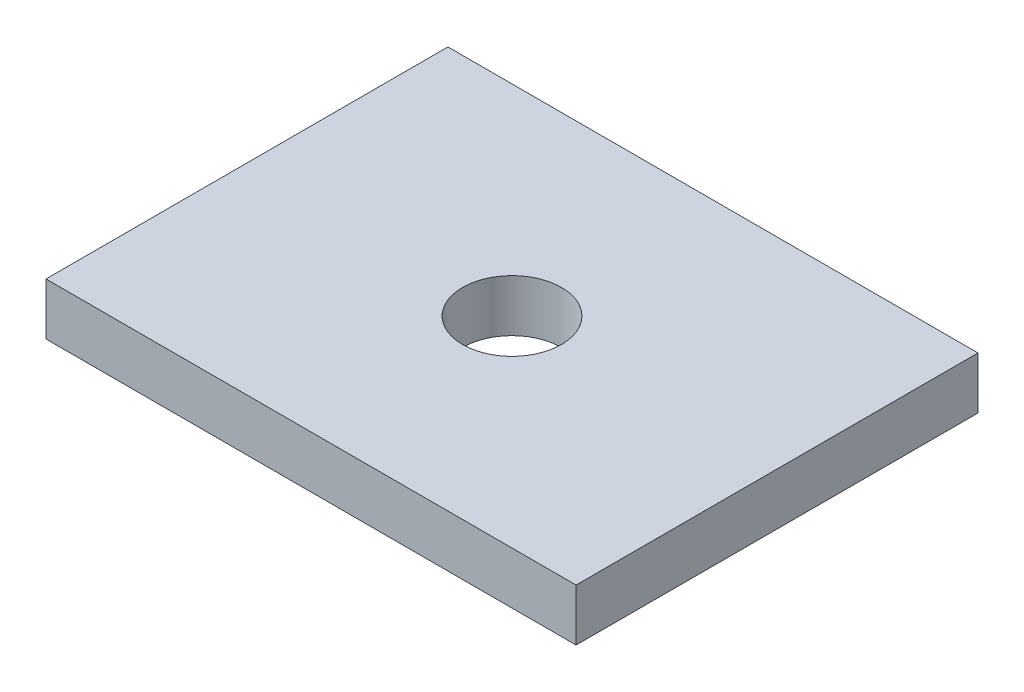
from build123d import *

# Parameters (mm, degrees)
SKIZZE1_W               = 101.944458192
SKIZZE1_H               = 77.295551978
LINEAR_AUSTRAGEN1_DEPTH = 10
SKIZZE2_R               = 9.512818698
LINEAR_AUSTRAGEN2_DEPTH = 10


with BuildPart() as part:
    # Skizze1 → Linear austragen1 (new body)
    with BuildSketch(Plane(origin=(0, 0, 0), x_dir=(1, 0, 0), z_dir=(0, 1, 0))):
        Rectangle(SKIZZE1_W, SKIZZE1_H)
    extrude(amount=LINEAR_AUSTRAGEN1_DEPTH)

    # Skizze2 → Linear austragen2 (cut)
    with BuildSketch(Plane(origin=(0, 10, 0), x_dir=(1, 0, 0), z_dir=(0, 1, 0))):
        with Locations(Location((0, 0, 0), (0, 0, 270))):
            Circle(SKIZZE2_R)
    extrude(amount=-LINEAR_AUSTRAGEN2_DEPTH, mode=Mode.SUBTRACT)


solid = part.part
